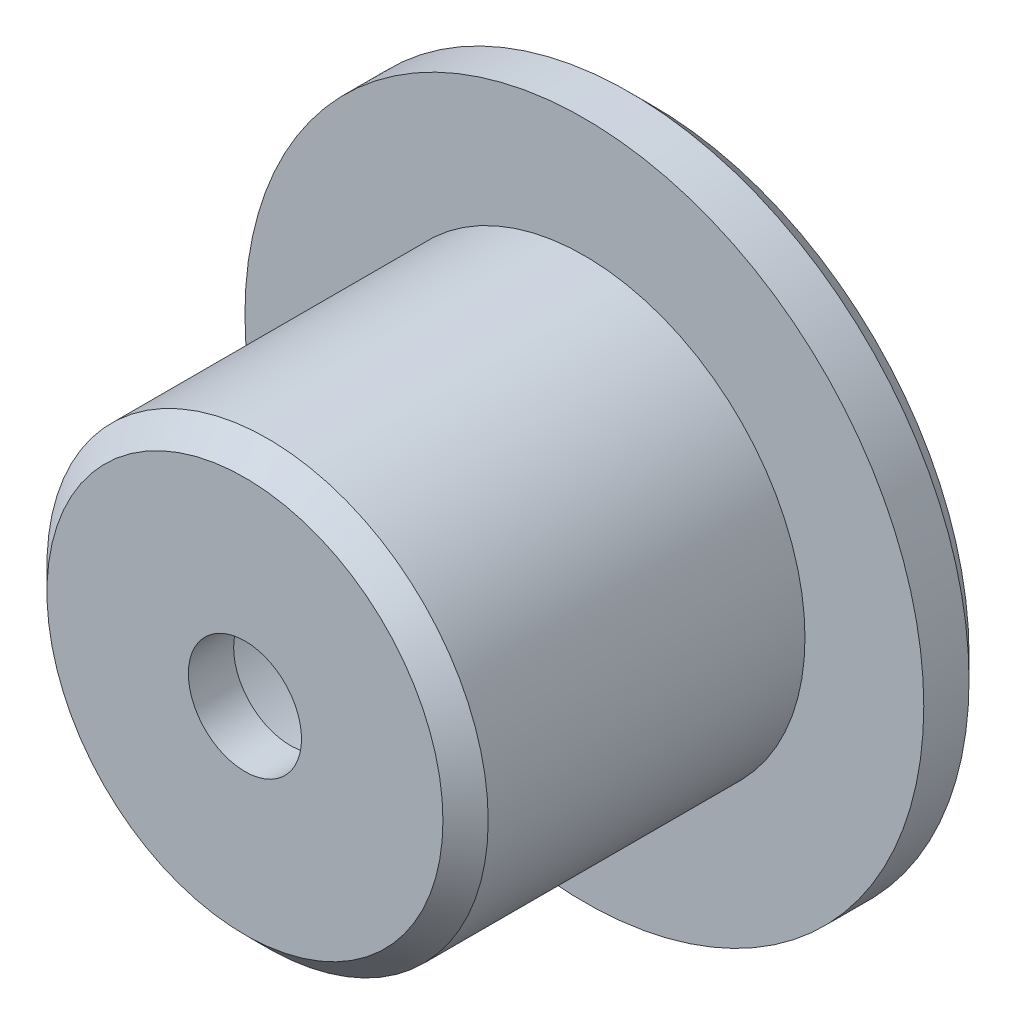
ISO-10303-21;
HEADER;
FILE_DESCRIPTION(('STEP AP214'),'2;1');
FILE_NAME('part.step','',(''),(''),'','','');
FILE_SCHEMA(('AUTOMOTIVE_DESIGN { 1 0 10303 214 1 1 1 1 }'));
ENDSEC;
DATA;
#1=APPLICATION_CONTEXT('core data for automotive mechanical design processes');
#2=APPLICATION_PROTOCOL_DEFINITION('international standard','automotive_design',2000,#1);
#3=PRODUCT_CONTEXT('',#1,'mechanical');
#4=PRODUCT('Part','Part','',(#3));
#5=PRODUCT_RELATED_PRODUCT_CATEGORY('part','',(#4));
#6=PRODUCT_DEFINITION_FORMATION('','',#4);
#7=PRODUCT_DEFINITION_CONTEXT('part definition',#1,'design');
#8=PRODUCT_DEFINITION('design','',#6,#7);
#9=PRODUCT_DEFINITION_SHAPE('','',#8);
#10=(LENGTH_UNIT() NAMED_UNIT(*) SI_UNIT(.MILLI.,.METRE.));
#11=(NAMED_UNIT(*) PLANE_ANGLE_UNIT() SI_UNIT($,.RADIAN.));
#12=(NAMED_UNIT(*) SI_UNIT($,.STERADIAN.) SOLID_ANGLE_UNIT());
#13=UNCERTAINTY_MEASURE_WITH_UNIT(LENGTH_MEASURE(1.E-05),#10,'distance_accuracy_value','');
#14=(GEOMETRIC_REPRESENTATION_CONTEXT(3) GLOBAL_UNCERTAINTY_ASSIGNED_CONTEXT((#13)) GLOBAL_UNIT_ASSIGNED_CONTEXT((#10,
#11,#12)) REPRESENTATION_CONTEXT('',''));
#15=CARTESIAN_POINT('',(0.,0.,0.));
#16=DIRECTION('',(0.,0.,1.));
#17=DIRECTION('',(1.,0.,0.));
#18=AXIS2_PLACEMENT_3D('',#15,#16,#17);
#19=CARTESIAN_POINT('',(0.,0.,3.));
#20=DIRECTION('',(0.,0.,-1.));
#21=DIRECTION('',(-1.,0.,0.));
#22=AXIS2_PLACEMENT_3D('',#19,#20,#21);
#23=CYLINDRICAL_SURFACE('',#22,15.);
#24=CARTESIAN_POINT('',(0.,0.,0.999999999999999));
#25=DIRECTION('',(0.,0.,1.));
#26=DIRECTION('',(1.,0.,0.));
#27=AXIS2_PLACEMENT_3D('',#24,#25,#26);
#28=CIRCLE('',#27,15.);
#29=CARTESIAN_POINT('',(15.,0.,0.999999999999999));
#30=VERTEX_POINT('',#29);
#31=EDGE_CURVE('E43',#30,#30,#28,.T.);
#32=ORIENTED_EDGE('',*,*,#31,.T.);
#33=EDGE_LOOP('',(#32));
#34=FACE_BOUND('',#33,.T.);
#35=CARTESIAN_POINT('',(0.,0.,3.));
#36=DIRECTION('',(0.,0.,1.));
#37=DIRECTION('',(1.,0.,0.));
#38=AXIS2_PLACEMENT_3D('',#35,#36,#37);
#39=CIRCLE('',#38,15.);
#40=CARTESIAN_POINT('',(15.,0.,3.));
#41=VERTEX_POINT('',#40);
#42=EDGE_CURVE('E58',#41,#41,#39,.T.);
#43=ORIENTED_EDGE('',*,*,#42,.F.);
#44=EDGE_LOOP('',(#43));
#45=FACE_BOUND('',#44,.T.);
#46=ADVANCED_FACE('F32',(#34,#45),#23,.T.);
#47=CARTESIAN_POINT('',(0.,0.,3.));
#48=DIRECTION('',(0.,0.,1.));
#49=DIRECTION('',(1.,0.,0.));
#50=AXIS2_PLACEMENT_3D('',#47,#48,#49);
#51=PLANE('',#50);
#52=CARTESIAN_POINT('',(0.,0.,3.));
#53=DIRECTION('',(0.,0.,1.));
#54=DIRECTION('',(1.,0.,0.));
#55=AXIS2_PLACEMENT_3D('',#52,#53,#54);
#56=CIRCLE('',#55,9.75);
#57=CARTESIAN_POINT('',(9.75,0.,3.));
#58=VERTEX_POINT('',#57);
#59=EDGE_CURVE('E61',#58,#58,#56,.T.);
#60=ORIENTED_EDGE('',*,*,#59,.F.);
#61=EDGE_LOOP('',(#60));
#62=FACE_BOUND('',#61,.T.);
#63=ORIENTED_EDGE('',*,*,#42,.T.);
#64=EDGE_LOOP('',(#63));
#65=FACE_BOUND('',#64,.T.);
#66=ADVANCED_FACE('F93',(#62,#65),#51,.T.);
#67=CARTESIAN_POINT('',(0.,0.,0.));
#68=DIRECTION('',(0.,0.,1.));
#69=DIRECTION('',(1.,0.,0.));
#70=AXIS2_PLACEMENT_3D('',#67,#68,#69);
#71=PLANE('',#70);
#72=CARTESIAN_POINT('',(0.,0.,0.));
#73=DIRECTION('',(0.,0.,1.));
#74=DIRECTION('',(1.,0.,0.));
#75=AXIS2_PLACEMENT_3D('',#72,#73,#74);
#76=CIRCLE('',#75,8.);
#77=CARTESIAN_POINT('',(8.,0.,0.));
#78=VERTEX_POINT('',#77);
#79=EDGE_CURVE('E47',#78,#78,#76,.T.);
#80=ORIENTED_EDGE('',*,*,#79,.T.);
#81=EDGE_LOOP('',(#80));
#82=FACE_BOUND('',#81,.T.);
#83=CARTESIAN_POINT('',(0.,0.,0.));
#84=DIRECTION('',(0.,0.,1.));
#85=DIRECTION('',(1.,0.,0.));
#86=AXIS2_PLACEMENT_3D('',#83,#84,#85);
#87=CIRCLE('',#86,14.);
#88=CARTESIAN_POINT('',(14.,0.,0.));
#89=VERTEX_POINT('',#88);
#90=EDGE_CURVE('E52',#89,#89,#87,.F.);
#91=ORIENTED_EDGE('',*,*,#90,.T.);
#92=EDGE_LOOP('',(#91));
#93=FACE_BOUND('',#92,.T.);
#94=ADVANCED_FACE('F99',(#82,#93),#71,.F.);
#95=CARTESIAN_POINT('',(0.,0.,18.));
#96=DIRECTION('',(0.,0.,-1.));
#97=DIRECTION('',(-1.,0.,0.));
#98=AXIS2_PLACEMENT_3D('',#95,#96,#97);
#99=CYLINDRICAL_SURFACE('',#98,9.75);
#100=CARTESIAN_POINT('',(0.,0.,17.));
#101=DIRECTION('',(0.,0.,1.));
#102=DIRECTION('',(1.,0.,0.));
#103=AXIS2_PLACEMENT_3D('',#100,#101,#102);
#104=CIRCLE('',#103,9.75);
#105=CARTESIAN_POINT('',(9.75,0.,17.));
#106=VERTEX_POINT('',#105);
#107=EDGE_CURVE('E10',#106,#106,#104,.F.);
#108=ORIENTED_EDGE('',*,*,#107,.T.);
#109=EDGE_LOOP('',(#108));
#110=FACE_BOUND('',#109,.T.);
#111=ORIENTED_EDGE('',*,*,#59,.T.);
#112=EDGE_LOOP('',(#111));
#113=FACE_BOUND('',#112,.T.);
#114=ADVANCED_FACE('F90',(#110,#113),#99,.T.);
#115=CARTESIAN_POINT('',(0.,0.,18.));
#116=DIRECTION('',(0.,0.,1.));
#117=DIRECTION('',(1.,0.,0.));
#118=AXIS2_PLACEMENT_3D('',#115,#116,#117);
#119=PLANE('',#118);
#120=CARTESIAN_POINT('',(0.,0.,18.));
#121=DIRECTION('',(0.,0.,1.));
#122=DIRECTION('',(1.,0.,0.));
#123=AXIS2_PLACEMENT_3D('',#120,#121,#122);
#124=CIRCLE('',#123,8.75);
#125=CARTESIAN_POINT('',(8.75,0.,18.));
#126=VERTEX_POINT('',#125);
#127=EDGE_CURVE('E39',#126,#126,#124,.T.);
#128=ORIENTED_EDGE('',*,*,#127,.T.);
#129=EDGE_LOOP('',(#128));
#130=FACE_BOUND('',#129,.T.);
#131=CARTESIAN_POINT('',(0.,0.,18.));
#132=DIRECTION('',(0.,0.,1.));
#133=DIRECTION('',(1.,0.,0.));
#134=AXIS2_PLACEMENT_3D('',#131,#132,#133);
#135=CIRCLE('',#134,2.5);
#136=CARTESIAN_POINT('',(2.5,0.,18.));
#137=VERTEX_POINT('',#136);
#138=EDGE_CURVE('E67',#137,#137,#135,.T.);
#139=ORIENTED_EDGE('',*,*,#138,.F.);
#140=EDGE_LOOP('',(#139));
#141=FACE_BOUND('',#140,.T.);
#142=ADVANCED_FACE('F84',(#130,#141),#119,.T.);
#143=CARTESIAN_POINT('',(0.,0.,16.));
#144=DIRECTION('',(0.,0.,-1.));
#145=DIRECTION('',(-1.,0.,0.));
#146=AXIS2_PLACEMENT_3D('',#143,#144,#145);
#147=CYLINDRICAL_SURFACE('',#146,7.);
#148=CARTESIAN_POINT('',(0.,0.,0.999999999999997));
#149=DIRECTION('',(0.,0.,1.));
#150=DIRECTION('',(1.,0.,0.));
#151=AXIS2_PLACEMENT_3D('',#148,#149,#150);
#152=CIRCLE('',#151,7.);
#153=CARTESIAN_POINT('',(7.,0.,0.999999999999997));
#154=VERTEX_POINT('',#153);
#155=EDGE_CURVE('E55',#154,#154,#152,.F.);
#156=ORIENTED_EDGE('',*,*,#155,.T.);
#157=EDGE_LOOP('',(#156));
#158=FACE_BOUND('',#157,.T.);
#159=CARTESIAN_POINT('',(0.,0.,16.));
#160=DIRECTION('',(0.,0.,-1.));
#161=DIRECTION('',(-1.,0.,0.));
#162=AXIS2_PLACEMENT_3D('',#159,#160,#161);
#163=CIRCLE('',#162,7.);
#164=CARTESIAN_POINT('',(-7.,0.,16.));
#165=VERTEX_POINT('',#164);
#166=EDGE_CURVE('E64',#165,#165,#163,.T.);
#167=ORIENTED_EDGE('',*,*,#166,.F.);
#168=EDGE_LOOP('',(#167));
#169=FACE_BOUND('',#168,.T.);
#170=ADVANCED_FACE('F79',(#158,#169),#147,.F.);
#171=CARTESIAN_POINT('',(0.,0.,16.));
#172=DIRECTION('',(0.,0.,-1.));
#173=DIRECTION('',(-1.,0.,0.));
#174=AXIS2_PLACEMENT_3D('',#171,#172,#173);
#175=PLANE('',#174);
#176=CARTESIAN_POINT('',(0.,0.,16.));
#177=DIRECTION('',(0.,0.,-1.));
#178=DIRECTION('',(-1.,0.,0.));
#179=AXIS2_PLACEMENT_3D('',#176,#177,#178);
#180=CIRCLE('',#179,2.5);
#181=CARTESIAN_POINT('',(-2.5,0.,16.));
#182=VERTEX_POINT('',#181);
#183=EDGE_CURVE('E70',#182,#182,#180,.T.);
#184=ORIENTED_EDGE('',*,*,#183,.F.);
#185=EDGE_LOOP('',(#184));
#186=FACE_BOUND('',#185,.T.);
#187=ORIENTED_EDGE('',*,*,#166,.T.);
#188=EDGE_LOOP('',(#187));
#189=FACE_BOUND('',#188,.T.);
#190=ADVANCED_FACE('F76',(#186,#189),#175,.T.);
#191=CARTESIAN_POINT('',(0.,0.,30.));
#192=DIRECTION('',(0.,0.,-1.));
#193=DIRECTION('',(-1.,0.,0.));
#194=AXIS2_PLACEMENT_3D('',#191,#192,#193);
#195=CYLINDRICAL_SURFACE('',#194,2.5);
#196=ORIENTED_EDGE('',*,*,#138,.T.);
#197=EDGE_LOOP('',(#196));
#198=FACE_BOUND('',#197,.T.);
#199=ORIENTED_EDGE('',*,*,#183,.T.);
#200=EDGE_LOOP('',(#199));
#201=FACE_BOUND('',#200,.T.);
#202=ADVANCED_FACE('F74',(#198,#201),#195,.F.);
#203=CARTESIAN_POINT('',(0.,0.,0.999999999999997));
#204=DIRECTION('',(0.,0.,-1.));
#205=DIRECTION('',(-1.,0.,0.));
#206=AXIS2_PLACEMENT_3D('',#203,#204,#205);
#207=CONICAL_SURFACE('',#206,7.,0.78539816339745);
#208=ORIENTED_EDGE('',*,*,#79,.F.);
#209=EDGE_LOOP('',(#208));
#210=FACE_BOUND('',#209,.T.);
#211=ORIENTED_EDGE('',*,*,#155,.F.);
#212=EDGE_LOOP('',(#211));
#213=FACE_BOUND('',#212,.T.);
#214=ADVANCED_FACE('F105',(#210,#213),#207,.F.);
#215=CARTESIAN_POINT('',(0.,0.,0.999999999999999));
#216=DIRECTION('',(0.,0.,1.));
#217=DIRECTION('',(1.,0.,0.));
#218=AXIS2_PLACEMENT_3D('',#215,#216,#217);
#219=CONICAL_SURFACE('',#218,15.,0.785398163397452);
#220=ORIENTED_EDGE('',*,*,#90,.F.);
#221=EDGE_LOOP('',(#220));
#222=FACE_BOUND('',#221,.T.);
#223=ORIENTED_EDGE('',*,*,#31,.F.);
#224=EDGE_LOOP('',(#223));
#225=FACE_BOUND('',#224,.T.);
#226=ADVANCED_FACE('F107',(#222,#225),#219,.T.);
#227=CARTESIAN_POINT('',(0.,0.,18.));
#228=DIRECTION('',(0.,0.,-1.));
#229=DIRECTION('',(-1.,0.,0.));
#230=AXIS2_PLACEMENT_3D('',#227,#228,#229);
#231=CONICAL_SURFACE('',#230,8.75,0.785398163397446);
#232=ORIENTED_EDGE('',*,*,#107,.F.);
#233=EDGE_LOOP('',(#232));
#234=FACE_BOUND('',#233,.T.);
#235=ORIENTED_EDGE('',*,*,#127,.F.);
#236=EDGE_LOOP('',(#235));
#237=FACE_BOUND('',#236,.T.);
#238=ADVANCED_FACE('F34',(#234,#237),#231,.T.);
#239=CLOSED_SHELL('',(#46,#66,#94,#114,#142,#170,#190,#202,#214,#226,#238));
#240=MANIFOLD_SOLID_BREP('B2',#239);
#241=ADVANCED_BREP_SHAPE_REPRESENTATION('',(#18,#240),#14);
#242=SHAPE_DEFINITION_REPRESENTATION(#9,#241);
ENDSEC;
END-ISO-10303-21;
